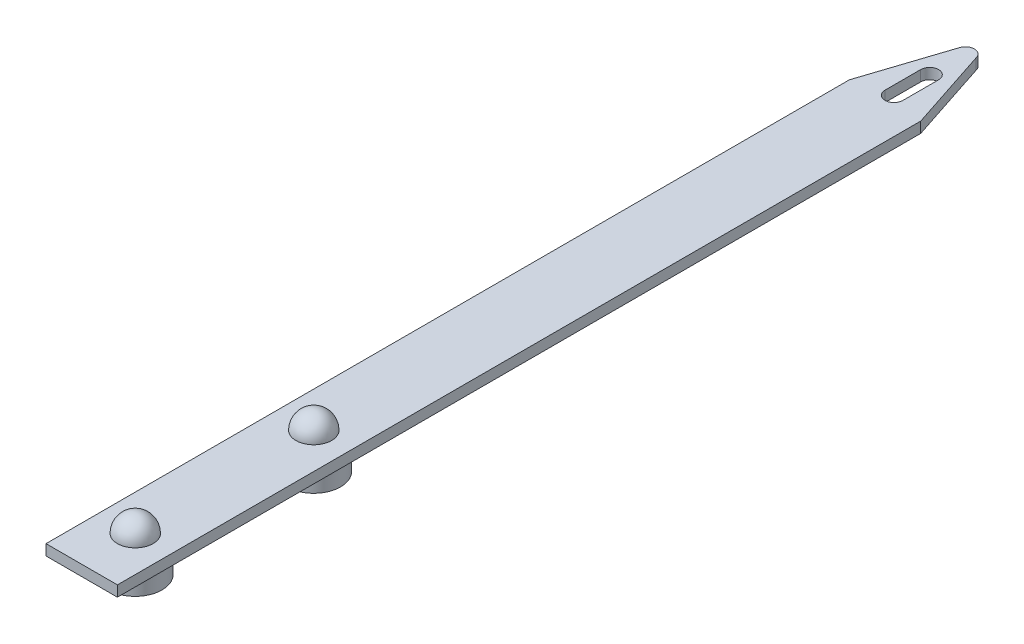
ISO-10303-21;
HEADER;
FILE_DESCRIPTION(('STEP AP214'),'2;1');
FILE_NAME('part.step','',(''),(''),'','','');
FILE_SCHEMA(('AUTOMOTIVE_DESIGN { 1 0 10303 214 1 1 1 1 }'));
ENDSEC;
DATA;
#1=APPLICATION_CONTEXT('core data for automotive mechanical design processes');
#2=APPLICATION_PROTOCOL_DEFINITION('international standard','automotive_design',2000,#1);
#3=PRODUCT_CONTEXT('',#1,'mechanical');
#4=PRODUCT('Part','Part','',(#3));
#5=PRODUCT_RELATED_PRODUCT_CATEGORY('part','',(#4));
#6=PRODUCT_DEFINITION_FORMATION('','',#4);
#7=PRODUCT_DEFINITION_CONTEXT('part definition',#1,'design');
#8=PRODUCT_DEFINITION('design','',#6,#7);
#9=PRODUCT_DEFINITION_SHAPE('','',#8);
#10=(LENGTH_UNIT() NAMED_UNIT(*) SI_UNIT(.MILLI.,.METRE.));
#11=(NAMED_UNIT(*) PLANE_ANGLE_UNIT() SI_UNIT($,.RADIAN.));
#12=(NAMED_UNIT(*) SI_UNIT($,.STERADIAN.) SOLID_ANGLE_UNIT());
#13=UNCERTAINTY_MEASURE_WITH_UNIT(LENGTH_MEASURE(1.E-05),#10,'distance_accuracy_value','');
#14=(GEOMETRIC_REPRESENTATION_CONTEXT(3) GLOBAL_UNCERTAINTY_ASSIGNED_CONTEXT((#13)) GLOBAL_UNIT_ASSIGNED_CONTEXT((#10,
#11,#12)) REPRESENTATION_CONTEXT('',''));
#15=CARTESIAN_POINT('',(0.,0.,0.));
#16=DIRECTION('',(0.,0.,1.));
#17=DIRECTION('',(1.,0.,0.));
#18=AXIS2_PLACEMENT_3D('',#15,#16,#17);
#19=CARTESIAN_POINT('',(0.,0.,-20.));
#20=DIRECTION('',(0.,-1.,0.));
#21=DIRECTION('',(0.,0.,-1.));
#22=AXIS2_PLACEMENT_3D('',#19,#20,#21);
#23=PLANE('',#22);
#24=CARTESIAN_POINT('',(2.,0.,27.));
#25=DIRECTION('',(0.,-1.,0.));
#26=DIRECTION('',(0.,0.,-1.));
#27=AXIS2_PLACEMENT_3D('',#24,#25,#26);
#28=CIRCLE('',#27,1.5);
#29=CARTESIAN_POINT('',(2.,0.,25.5));
#30=VERTEX_POINT('',#29);
#31=EDGE_CURVE('E444',#30,#30,#28,.T.);
#32=ORIENTED_EDGE('',*,*,#31,.F.);
#33=EDGE_LOOP('',(#32));
#34=FACE_BOUND('',#33,.T.);
#35=CARTESIAN_POINT('',(2.,0.,-17.5));
#36=DIRECTION('',(0.,1.,0.));
#37=DIRECTION('',(0.,0.,1.));
#38=AXIS2_PLACEMENT_3D('',#35,#36,#37);
#39=CIRCLE('',#38,0.5);
#40=CARTESIAN_POINT('',(2.5,0.,-17.5));
#41=VERTEX_POINT('',#40);
#42=CARTESIAN_POINT('',(1.5,0.,-17.5));
#43=VERTEX_POINT('',#42);
#44=EDGE_CURVE('E216',#41,#43,#39,.T.);
#45=ORIENTED_EDGE('',*,*,#44,.T.);
#46=DIRECTION('',(0.,0.,-1.));
#47=VECTOR('',#46,1.);
#48=CARTESIAN_POINT('',(1.5,0.,0.));
#49=LINE('',#48,#47);
#50=CARTESIAN_POINT('',(1.5,0.,-15.5));
#51=VERTEX_POINT('',#50);
#52=EDGE_CURVE('E219',#51,#43,#49,.T.);
#53=ORIENTED_EDGE('',*,*,#52,.F.);
#54=CARTESIAN_POINT('',(2.,0.,-15.5));
#55=DIRECTION('',(0.,1.,0.));
#56=DIRECTION('',(0.,0.,1.));
#57=AXIS2_PLACEMENT_3D('',#54,#55,#56);
#58=CIRCLE('',#57,0.5);
#59=CARTESIAN_POINT('',(2.5,0.,-15.5));
#60=VERTEX_POINT('',#59);
#61=EDGE_CURVE('E128',#51,#60,#58,.T.);
#62=ORIENTED_EDGE('',*,*,#61,.T.);
#63=DIRECTION('',(0.,0.,-1.));
#64=VECTOR('',#63,1.);
#65=CARTESIAN_POINT('',(2.5,0.,0.));
#66=LINE('',#65,#64);
#67=EDGE_CURVE('E223',#60,#41,#66,.T.);
#68=ORIENTED_EDGE('',*,*,#67,.T.);
#69=EDGE_LOOP('',(#45,#53,#62,#68));
#70=FACE_BOUND('',#69,.T.);
#71=DIRECTION('',(0.311256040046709,0.,-0.950326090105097));
#72=VECTOR('',#71,1.);
#73=CARTESIAN_POINT('',(-7.28610313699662,0.,7.24591016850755));
#74=LINE('',#73,#72);
#75=CARTESIAN_POINT('',(0.,0.,-15.));
#76=VERTEX_POINT('',#75);
#77=CARTESIAN_POINT('',(1.52483695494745,0.,-19.6556280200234));
#78=VERTEX_POINT('',#77);
#79=EDGE_CURVE('E238',#76,#78,#74,.T.);
#80=ORIENTED_EDGE('',*,*,#79,.T.);
#81=CARTESIAN_POINT('',(2.,0.,-19.5));
#82=DIRECTION('',(0.,1.,0.));
#83=DIRECTION('',(0.,0.,1.));
#84=AXIS2_PLACEMENT_3D('',#81,#82,#83);
#85=CIRCLE('',#84,0.5);
#86=CARTESIAN_POINT('',(2.4903123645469,0.,-19.5979478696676));
#87=VERTEX_POINT('',#86);
#88=EDGE_CURVE('E253',#87,#78,#85,.T.);
#89=ORIENTED_EDGE('',*,*,#88,.F.);
#90=DIRECTION('',(-0.311954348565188,0.,-0.95009709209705));
#91=VECTOR('',#90,1.);
#92=CARTESIAN_POINT('',(5.1945609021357,0.,-11.3618111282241));
#93=LINE('',#92,#91);
#94=CARTESIAN_POINT('',(4.,0.,-15.));
#95=VERTEX_POINT('',#94);
#96=EDGE_CURVE('E255',#95,#87,#93,.T.);
#97=ORIENTED_EDGE('',*,*,#96,.F.);
#98=DIRECTION('',(0.,0.,1.));
#99=VECTOR('',#98,1.);
#100=CARTESIAN_POINT('',(4.,0.,-20.));
#101=LINE('',#100,#99);
#102=CARTESIAN_POINT('',(4.,0.,30.));
#103=VERTEX_POINT('',#102);
#104=EDGE_CURVE('E191',#95,#103,#101,.T.);
#105=ORIENTED_EDGE('',*,*,#104,.T.);
#106=DIRECTION('',(1.,0.,0.));
#107=VECTOR('',#106,1.);
#108=CARTESIAN_POINT('',(0.,0.,30.));
#109=LINE('',#108,#107);
#110=CARTESIAN_POINT('',(0.,0.,30.));
#111=VERTEX_POINT('',#110);
#112=EDGE_CURVE('E194',#111,#103,#109,.T.);
#113=ORIENTED_EDGE('',*,*,#112,.F.);
#114=DIRECTION('',(0.,0.,1.));
#115=VECTOR('',#114,1.);
#116=CARTESIAN_POINT('',(0.,0.,-20.));
#117=LINE('',#116,#115);
#118=EDGE_CURVE('E107',#76,#111,#117,.T.);
#119=ORIENTED_EDGE('',*,*,#118,.F.);
#120=EDGE_LOOP('',(#80,#89,#97,#105,#113,#119));
#121=FACE_BOUND('',#120,.T.);
#122=CARTESIAN_POINT('',(2.,0.,17.));
#123=DIRECTION('',(0.,-1.,0.));
#124=DIRECTION('',(0.,0.,-1.));
#125=AXIS2_PLACEMENT_3D('',#122,#123,#124);
#126=CIRCLE('',#125,1.5);
#127=CARTESIAN_POINT('',(2.,0.,15.5));
#128=VERTEX_POINT('',#127);
#129=EDGE_CURVE('E445',#128,#128,#126,.T.);
#130=ORIENTED_EDGE('',*,*,#129,.F.);
#131=EDGE_LOOP('',(#130));
#132=FACE_BOUND('',#131,.T.);
#133=ADVANCED_FACE('F103',(#34,#70,#121,#132),#23,.T.);
#134=CARTESIAN_POINT('',(0.,0.6,-20.));
#135=DIRECTION('',(0.,1.,0.));
#136=DIRECTION('',(0.,0.,1.));
#137=AXIS2_PLACEMENT_3D('',#134,#135,#136);
#138=PLANE('',#137);
#139=CARTESIAN_POINT('',(2.,0.6,17.));
#140=DIRECTION('',(0.,1.,0.));
#141=DIRECTION('',(0.,0.,1.));
#142=AXIS2_PLACEMENT_3D('',#139,#140,#141);
#143=CIRCLE('',#142,1.);
#144=CARTESIAN_POINT('',(2.,0.6,18.));
#145=VERTEX_POINT('',#144);
#146=EDGE_CURVE('E207',#145,#145,#143,.T.);
#147=ORIENTED_EDGE('',*,*,#146,.F.);
#148=EDGE_LOOP('',(#147));
#149=FACE_BOUND('',#148,.T.);
#150=CARTESIAN_POINT('',(2.,0.6,-17.5));
#151=DIRECTION('',(0.,1.,0.));
#152=DIRECTION('',(0.,0.,1.));
#153=AXIS2_PLACEMENT_3D('',#150,#151,#152);
#154=CIRCLE('',#153,0.5);
#155=CARTESIAN_POINT('',(2.5,0.6,-17.5));
#156=VERTEX_POINT('',#155);
#157=CARTESIAN_POINT('',(1.5,0.6,-17.5));
#158=VERTEX_POINT('',#157);
#159=EDGE_CURVE('E120',#156,#158,#154,.T.);
#160=ORIENTED_EDGE('',*,*,#159,.F.);
#161=DIRECTION('',(0.,0.,-1.));
#162=VECTOR('',#161,1.);
#163=CARTESIAN_POINT('',(2.5,0.6,0.));
#164=LINE('',#163,#162);
#165=CARTESIAN_POINT('',(2.5,0.6,-15.5));
#166=VERTEX_POINT('',#165);
#167=EDGE_CURVE('E220',#166,#156,#164,.T.);
#168=ORIENTED_EDGE('',*,*,#167,.F.);
#169=CARTESIAN_POINT('',(2.,0.6,-15.5));
#170=DIRECTION('',(0.,1.,0.));
#171=DIRECTION('',(0.,0.,1.));
#172=AXIS2_PLACEMENT_3D('',#169,#170,#171);
#173=CIRCLE('',#172,0.5);
#174=CARTESIAN_POINT('',(1.5,0.6,-15.5));
#175=VERTEX_POINT('',#174);
#176=EDGE_CURVE('E231',#175,#166,#173,.T.);
#177=ORIENTED_EDGE('',*,*,#176,.F.);
#178=DIRECTION('',(0.,0.,-1.));
#179=VECTOR('',#178,1.);
#180=CARTESIAN_POINT('',(1.5,0.6,0.));
#181=LINE('',#180,#179);
#182=EDGE_CURVE('E228',#175,#158,#181,.T.);
#183=ORIENTED_EDGE('',*,*,#182,.T.);
#184=EDGE_LOOP('',(#160,#168,#177,#183));
#185=FACE_BOUND('',#184,.T.);
#186=CARTESIAN_POINT('',(2.,0.6,-19.5));
#187=DIRECTION('',(0.,1.,0.));
#188=DIRECTION('',(0.,0.,1.));
#189=AXIS2_PLACEMENT_3D('',#186,#187,#188);
#190=CIRCLE('',#189,0.5);
#191=CARTESIAN_POINT('',(2.4903123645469,0.6,-19.5979478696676));
#192=VERTEX_POINT('',#191);
#193=CARTESIAN_POINT('',(1.52483695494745,0.6,-19.6556280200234));
#194=VERTEX_POINT('',#193);
#195=EDGE_CURVE('E251',#192,#194,#190,.T.);
#196=ORIENTED_EDGE('',*,*,#195,.T.);
#197=DIRECTION('',(0.311256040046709,0.,-0.950326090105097));
#198=VECTOR('',#197,1.);
#199=CARTESIAN_POINT('',(-7.28610313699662,0.6,7.24591016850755));
#200=LINE('',#199,#198);
#201=CARTESIAN_POINT('',(0.,0.6,-15.));
#202=VERTEX_POINT('',#201);
#203=EDGE_CURVE('E245',#202,#194,#200,.T.);
#204=ORIENTED_EDGE('',*,*,#203,.F.);
#205=DIRECTION('',(0.,0.,1.));
#206=VECTOR('',#205,1.);
#207=CARTESIAN_POINT('',(0.,0.6,-20.));
#208=LINE('',#207,#206);
#209=CARTESIAN_POINT('',(0.,0.6,30.));
#210=VERTEX_POINT('',#209);
#211=EDGE_CURVE('E12',#202,#210,#208,.T.);
#212=ORIENTED_EDGE('',*,*,#211,.T.);
#213=DIRECTION('',(-1.,0.,0.));
#214=VECTOR('',#213,1.);
#215=CARTESIAN_POINT('',(0.,0.6,30.));
#216=LINE('',#215,#214);
#217=CARTESIAN_POINT('',(4.,0.6,30.));
#218=VERTEX_POINT('',#217);
#219=EDGE_CURVE('E206',#218,#210,#216,.T.);
#220=ORIENTED_EDGE('',*,*,#219,.F.);
#221=DIRECTION('',(0.,0.,1.));
#222=VECTOR('',#221,1.);
#223=CARTESIAN_POINT('',(4.,0.6,-20.));
#224=LINE('',#223,#222);
#225=CARTESIAN_POINT('',(4.,0.6,-15.));
#226=VERTEX_POINT('',#225);
#227=EDGE_CURVE('E112',#226,#218,#224,.T.);
#228=ORIENTED_EDGE('',*,*,#227,.F.);
#229=DIRECTION('',(-0.311954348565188,0.,-0.95009709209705));
#230=VECTOR('',#229,1.);
#231=CARTESIAN_POINT('',(5.1945609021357,0.6,-11.3618111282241));
#232=LINE('',#231,#230);
#233=EDGE_CURVE('E256',#226,#192,#232,.T.);
#234=ORIENTED_EDGE('',*,*,#233,.T.);
#235=EDGE_LOOP('',(#196,#204,#212,#220,#228,#234));
#236=FACE_BOUND('',#235,.T.);
#237=CARTESIAN_POINT('',(2.,0.6,27.));
#238=DIRECTION('',(0.,1.,0.));
#239=DIRECTION('',(0.,0.,1.));
#240=AXIS2_PLACEMENT_3D('',#237,#238,#239);
#241=CIRCLE('',#240,1.);
#242=CARTESIAN_POINT('',(2.,0.6,28.));
#243=VERTEX_POINT('',#242);
#244=EDGE_CURVE('E210',#243,#243,#241,.T.);
#245=ORIENTED_EDGE('',*,*,#244,.F.);
#246=EDGE_LOOP('',(#245));
#247=FACE_BOUND('',#246,.T.);
#248=ADVANCED_FACE('F269',(#149,#185,#236,#247),#138,.T.);
#249=CARTESIAN_POINT('',(4.,0.,-20.));
#250=DIRECTION('',(1.,0.,0.));
#251=DIRECTION('',(0.,0.,-1.));
#252=AXIS2_PLACEMENT_3D('',#249,#250,#251);
#253=PLANE('',#252);
#254=ORIENTED_EDGE('',*,*,#104,.F.);
#255=DIRECTION('',(0.,1.,0.));
#256=VECTOR('',#255,1.);
#257=CARTESIAN_POINT('',(4.,0.,-15.));
#258=LINE('',#257,#256);
#259=EDGE_CURVE('E192',#95,#226,#258,.T.);
#260=ORIENTED_EDGE('',*,*,#259,.T.);
#261=ORIENTED_EDGE('',*,*,#227,.T.);
#262=DIRECTION('',(0.,1.,0.));
#263=VECTOR('',#262,1.);
#264=CARTESIAN_POINT('',(4.,0.6,30.));
#265=LINE('',#264,#263);
#266=EDGE_CURVE('E201',#103,#218,#265,.T.);
#267=ORIENTED_EDGE('',*,*,#266,.F.);
#268=EDGE_LOOP('',(#254,#260,#261,#267));
#269=FACE_BOUND('',#268,.T.);
#270=ADVANCED_FACE('F267',(#269),#253,.T.);
#271=CARTESIAN_POINT('',(0.,0.,-20.));
#272=DIRECTION('',(-1.,0.,0.));
#273=DIRECTION('',(0.,0.,1.));
#274=AXIS2_PLACEMENT_3D('',#271,#272,#273);
#275=PLANE('',#274);
#276=DIRECTION('',(0.,1.,0.));
#277=VECTOR('',#276,1.);
#278=CARTESIAN_POINT('',(0.,0.,-15.));
#279=LINE('',#278,#277);
#280=EDGE_CURVE('E188',#76,#202,#279,.T.);
#281=ORIENTED_EDGE('',*,*,#280,.F.);
#282=ORIENTED_EDGE('',*,*,#118,.T.);
#283=DIRECTION('',(0.,-1.,0.));
#284=VECTOR('',#283,1.);
#285=CARTESIAN_POINT('',(0.,0.6,30.));
#286=LINE('',#285,#284);
#287=EDGE_CURVE('E187',#210,#111,#286,.T.);
#288=ORIENTED_EDGE('',*,*,#287,.F.);
#289=ORIENTED_EDGE('',*,*,#211,.F.);
#290=EDGE_LOOP('',(#281,#282,#288,#289));
#291=FACE_BOUND('',#290,.T.);
#292=ADVANCED_FACE('F184',(#291),#275,.T.);
#293=CARTESIAN_POINT('',(2.,0.,-19.5));
#294=DIRECTION('',(0.,1.,0.));
#295=DIRECTION('',(0.,0.,1.));
#296=AXIS2_PLACEMENT_3D('',#293,#294,#295);
#297=CYLINDRICAL_SURFACE('',#296,0.5);
#298=ORIENTED_EDGE('',*,*,#195,.F.);
#299=DIRECTION('',(0.,1.,0.));
#300=VECTOR('',#299,1.);
#301=CARTESIAN_POINT('',(2.4903123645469,0.,-19.5979478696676));
#302=LINE('',#301,#300);
#303=EDGE_CURVE('E258',#87,#192,#302,.T.);
#304=ORIENTED_EDGE('',*,*,#303,.F.);
#305=ORIENTED_EDGE('',*,*,#88,.T.);
#306=DIRECTION('',(0.,1.,0.));
#307=VECTOR('',#306,1.);
#308=CARTESIAN_POINT('',(1.52483695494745,0.,-19.6556280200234));
#309=LINE('',#308,#307);
#310=EDGE_CURVE('E246',#78,#194,#309,.T.);
#311=ORIENTED_EDGE('',*,*,#310,.T.);
#312=EDGE_LOOP('',(#298,#304,#305,#311));
#313=FACE_BOUND('',#312,.T.);
#314=ADVANCED_FACE('F279',(#313),#297,.T.);
#315=CARTESIAN_POINT('',(5.1945609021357,0.,-11.3618111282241));
#316=DIRECTION('',(0.95009709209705,0.,-0.311954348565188));
#317=DIRECTION('',(-0.311954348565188,0.,-0.95009709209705));
#318=AXIS2_PLACEMENT_3D('',#315,#316,#317);
#319=PLANE('',#318);
#320=ORIENTED_EDGE('',*,*,#233,.F.);
#321=ORIENTED_EDGE('',*,*,#259,.F.);
#322=ORIENTED_EDGE('',*,*,#96,.T.);
#323=ORIENTED_EDGE('',*,*,#303,.T.);
#324=EDGE_LOOP('',(#320,#321,#322,#323));
#325=FACE_BOUND('',#324,.T.);
#326=ADVANCED_FACE('F281',(#325),#319,.T.);
#327=CARTESIAN_POINT('',(-7.28610313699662,0.,7.24591016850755));
#328=DIRECTION('',(0.950326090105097,0.,0.311256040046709));
#329=DIRECTION('',(0.311256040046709,0.,-0.950326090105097));
#330=AXIS2_PLACEMENT_3D('',#327,#328,#329);
#331=PLANE('',#330);
#332=ORIENTED_EDGE('',*,*,#203,.T.);
#333=ORIENTED_EDGE('',*,*,#310,.F.);
#334=ORIENTED_EDGE('',*,*,#79,.F.);
#335=ORIENTED_EDGE('',*,*,#280,.T.);
#336=EDGE_LOOP('',(#332,#333,#334,#335));
#337=FACE_BOUND('',#336,.T.);
#338=ADVANCED_FACE('F275',(#337),#331,.F.);
#339=CARTESIAN_POINT('',(2.,0.,-17.5));
#340=DIRECTION('',(0.,1.,0.));
#341=DIRECTION('',(0.,0.,1.));
#342=AXIS2_PLACEMENT_3D('',#339,#340,#341);
#343=CYLINDRICAL_SURFACE('',#342,0.5);
#344=ORIENTED_EDGE('',*,*,#159,.T.);
#345=DIRECTION('',(0.,1.,0.));
#346=VECTOR('',#345,1.);
#347=CARTESIAN_POINT('',(1.5,0.,-17.5));
#348=LINE('',#347,#346);
#349=EDGE_CURVE('E226',#43,#158,#348,.T.);
#350=ORIENTED_EDGE('',*,*,#349,.F.);
#351=ORIENTED_EDGE('',*,*,#44,.F.);
#352=DIRECTION('',(0.,1.,0.));
#353=VECTOR('',#352,1.);
#354=CARTESIAN_POINT('',(2.5,0.,-17.5));
#355=LINE('',#354,#353);
#356=EDGE_CURVE('E236',#41,#156,#355,.T.);
#357=ORIENTED_EDGE('',*,*,#356,.T.);
#358=EDGE_LOOP('',(#344,#350,#351,#357));
#359=FACE_BOUND('',#358,.T.);
#360=ADVANCED_FACE('F288',(#359),#343,.F.);
#361=CARTESIAN_POINT('',(2.5,0.,0.));
#362=DIRECTION('',(1.,0.,0.));
#363=DIRECTION('',(0.,0.,-1.));
#364=AXIS2_PLACEMENT_3D('',#361,#362,#363);
#365=PLANE('',#364);
#366=ORIENTED_EDGE('',*,*,#167,.T.);
#367=ORIENTED_EDGE('',*,*,#356,.F.);
#368=ORIENTED_EDGE('',*,*,#67,.F.);
#369=DIRECTION('',(0.,1.,0.));
#370=VECTOR('',#369,1.);
#371=CARTESIAN_POINT('',(2.5,0.,-15.5));
#372=LINE('',#371,#370);
#373=EDGE_CURVE('E239',#60,#166,#372,.T.);
#374=ORIENTED_EDGE('',*,*,#373,.T.);
#375=EDGE_LOOP('',(#366,#367,#368,#374));
#376=FACE_BOUND('',#375,.T.);
#377=ADVANCED_FACE('F325',(#376),#365,.F.);
#378=CARTESIAN_POINT('',(2.,0.,-15.5));
#379=DIRECTION('',(0.,1.,0.));
#380=DIRECTION('',(0.,0.,1.));
#381=AXIS2_PLACEMENT_3D('',#378,#379,#380);
#382=CYLINDRICAL_SURFACE('',#381,0.5);
#383=ORIENTED_EDGE('',*,*,#176,.T.);
#384=ORIENTED_EDGE('',*,*,#373,.F.);
#385=ORIENTED_EDGE('',*,*,#61,.F.);
#386=DIRECTION('',(0.,1.,0.));
#387=VECTOR('',#386,1.);
#388=CARTESIAN_POINT('',(1.5,0.,-15.5));
#389=LINE('',#388,#387);
#390=EDGE_CURVE('E241',#51,#175,#389,.T.);
#391=ORIENTED_EDGE('',*,*,#390,.T.);
#392=EDGE_LOOP('',(#383,#384,#385,#391));
#393=FACE_BOUND('',#392,.T.);
#394=ADVANCED_FACE('F326',(#393),#382,.F.);
#395=CARTESIAN_POINT('',(1.5,0.,0.));
#396=DIRECTION('',(1.,0.,0.));
#397=DIRECTION('',(0.,0.,-1.));
#398=AXIS2_PLACEMENT_3D('',#395,#396,#397);
#399=PLANE('',#398);
#400=ORIENTED_EDGE('',*,*,#182,.F.);
#401=ORIENTED_EDGE('',*,*,#390,.F.);
#402=ORIENTED_EDGE('',*,*,#52,.T.);
#403=ORIENTED_EDGE('',*,*,#349,.T.);
#404=EDGE_LOOP('',(#400,#401,#402,#403));
#405=FACE_BOUND('',#404,.T.);
#406=ADVANCED_FACE('F313',(#405),#399,.T.);
#407=CARTESIAN_POINT('',(0.,0.,30.));
#408=DIRECTION('',(0.,0.,1.));
#409=DIRECTION('',(1.,0.,0.));
#410=AXIS2_PLACEMENT_3D('',#407,#408,#409);
#411=PLANE('',#410);
#412=ORIENTED_EDGE('',*,*,#287,.T.);
#413=ORIENTED_EDGE('',*,*,#112,.T.);
#414=ORIENTED_EDGE('',*,*,#266,.T.);
#415=ORIENTED_EDGE('',*,*,#219,.T.);
#416=EDGE_LOOP('',(#412,#413,#414,#415));
#417=FACE_BOUND('',#416,.T.);
#418=ADVANCED_FACE('F204',(#417),#411,.T.);
#419=CARTESIAN_POINT('',(2.,0.6,17.));
#420=DIRECTION('',(0.,0.,1.));
#421=DIRECTION('',(1.,0.,0.));
#422=AXIS2_PLACEMENT_3D('',#419,#420,#421);
#423=SPHERICAL_SURFACE('',#422,1.);
#424=CARTESIAN_POINT('',(2.,0.6,17.));
#425=DIRECTION('',(0.,1.,0.));
#426=DIRECTION('',(0.,0.,1.));
#427=AXIS2_PLACEMENT_3D('',#424,#425,#426);
#428=SPHERICAL_SURFACE('',#427,1.);
#429=ORIENTED_EDGE('',*,*,#146,.T.);
#430=EDGE_LOOP('',(#429));
#431=FACE_BOUND('',#430,.T.);
#432=ADVANCED_FACE('F304',(#431),#428,.T.);
#433=CARTESIAN_POINT('',(2.,0.6,27.));
#434=DIRECTION('',(0.,0.,1.));
#435=DIRECTION('',(1.,0.,0.));
#436=AXIS2_PLACEMENT_3D('',#433,#434,#435);
#437=SPHERICAL_SURFACE('',#436,1.);
#438=CARTESIAN_POINT('',(2.,0.6,27.));
#439=DIRECTION('',(0.,1.,0.));
#440=DIRECTION('',(0.,0.,1.));
#441=AXIS2_PLACEMENT_3D('',#438,#439,#440);
#442=SPHERICAL_SURFACE('',#441,1.);
#443=ORIENTED_EDGE('',*,*,#244,.T.);
#444=EDGE_LOOP('',(#443));
#445=FACE_BOUND('',#444,.T.);
#446=ADVANCED_FACE('F105',(#445),#442,.T.);
#447=CARTESIAN_POINT('',(2.,-1.4,27.));
#448=DIRECTION('',(0.,1.,0.));
#449=DIRECTION('',(0.,0.,1.));
#450=AXIS2_PLACEMENT_3D('',#447,#448,#449);
#451=CYLINDRICAL_SURFACE('',#450,1.5);
#452=CARTESIAN_POINT('',(2.,-1.4,27.));
#453=DIRECTION('',(0.,-1.,0.));
#454=DIRECTION('',(0.,0.,-1.));
#455=AXIS2_PLACEMENT_3D('',#452,#453,#454);
#456=CIRCLE('',#455,1.5);
#457=CARTESIAN_POINT('',(2.,-1.4,25.5));
#458=VERTEX_POINT('',#457);
#459=EDGE_CURVE('E448',#458,#458,#456,.T.);
#460=ORIENTED_EDGE('',*,*,#459,.F.);
#461=EDGE_LOOP('',(#460));
#462=FACE_BOUND('',#461,.T.);
#463=ORIENTED_EDGE('',*,*,#31,.T.);
#464=EDGE_LOOP('',(#463));
#465=FACE_BOUND('',#464,.T.);
#466=ADVANCED_FACE('F311',(#462,#465),#451,.T.);
#467=CARTESIAN_POINT('',(2.,-1.4,27.));
#468=DIRECTION('',(0.,-1.,0.));
#469=DIRECTION('',(0.,0.,-1.));
#470=AXIS2_PLACEMENT_3D('',#467,#468,#469);
#471=PLANE('',#470);
#472=ORIENTED_EDGE('',*,*,#459,.T.);
#473=EDGE_LOOP('',(#472));
#474=FACE_BOUND('',#473,.T.);
#475=ADVANCED_FACE('F407',(#474),#471,.T.);
#476=CARTESIAN_POINT('',(2.,-1.4,17.));
#477=DIRECTION('',(0.,1.,0.));
#478=DIRECTION('',(0.,0.,1.));
#479=AXIS2_PLACEMENT_3D('',#476,#477,#478);
#480=CYLINDRICAL_SURFACE('',#479,1.5);
#481=CARTESIAN_POINT('',(2.,-1.4,17.));
#482=DIRECTION('',(0.,-1.,0.));
#483=DIRECTION('',(0.,0.,-1.));
#484=AXIS2_PLACEMENT_3D('',#481,#482,#483);
#485=CIRCLE('',#484,1.5);
#486=CARTESIAN_POINT('',(2.,-1.4,15.5));
#487=VERTEX_POINT('',#486);
#488=EDGE_CURVE('E443',#487,#487,#485,.T.);
#489=ORIENTED_EDGE('',*,*,#488,.F.);
#490=EDGE_LOOP('',(#489));
#491=FACE_BOUND('',#490,.T.);
#492=ORIENTED_EDGE('',*,*,#129,.T.);
#493=EDGE_LOOP('',(#492));
#494=FACE_BOUND('',#493,.T.);
#495=ADVANCED_FACE('F417',(#491,#494),#480,.T.);
#496=CARTESIAN_POINT('',(2.,-1.4,17.));
#497=DIRECTION('',(0.,-1.,0.));
#498=DIRECTION('',(0.,0.,-1.));
#499=AXIS2_PLACEMENT_3D('',#496,#497,#498);
#500=PLANE('',#499);
#501=ORIENTED_EDGE('',*,*,#488,.T.);
#502=EDGE_LOOP('',(#501));
#503=FACE_BOUND('',#502,.T.);
#504=ADVANCED_FACE('F427',(#503),#500,.T.);
#505=CLOSED_SHELL('',(#133,#248,#270,#292,#314,#326,#338,#360,#377,#394,#406,#418,#432,#446,
#466,#475,#495,#504));
#506=MANIFOLD_SOLID_BREP('B2',#505);
#507=ADVANCED_BREP_SHAPE_REPRESENTATION('',(#18,#506),#14);
#508=SHAPE_DEFINITION_REPRESENTATION(#9,#507);
ENDSEC;
END-ISO-10303-21;
